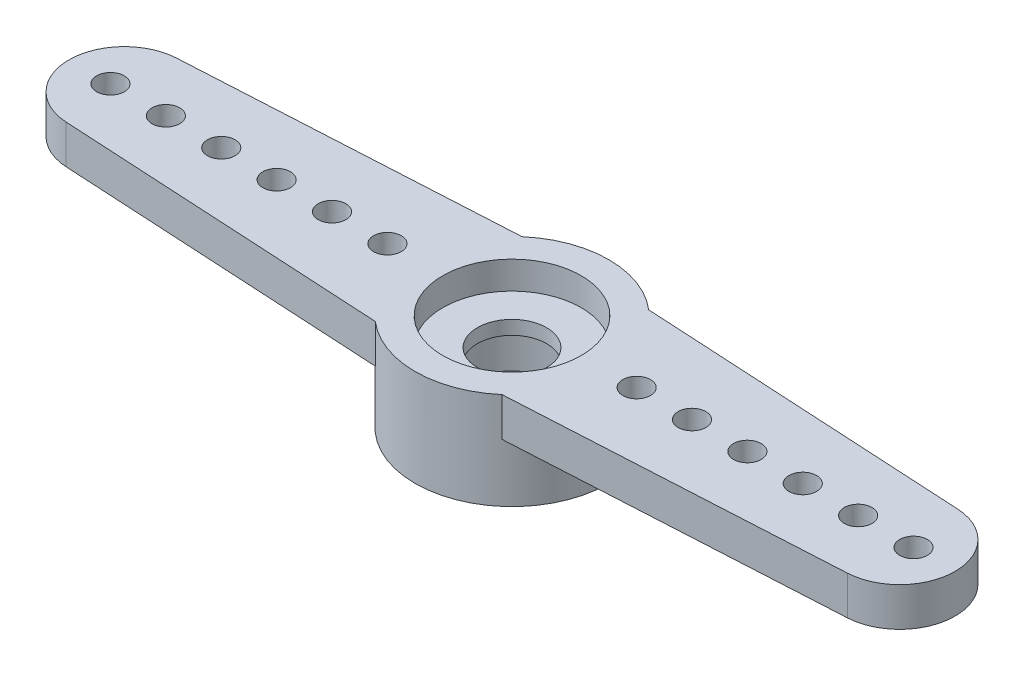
ISO-10303-21;
HEADER;
FILE_DESCRIPTION(('STEP AP214'),'2;1');
FILE_NAME('part.step','',(''),(''),'','','');
FILE_SCHEMA(('AUTOMOTIVE_DESIGN { 1 0 10303 214 1 1 1 1 }'));
ENDSEC;
DATA;
#1=APPLICATION_CONTEXT('core data for automotive mechanical design processes');
#2=APPLICATION_PROTOCOL_DEFINITION('international standard','automotive_design',2000,#1);
#3=PRODUCT_CONTEXT('',#1,'mechanical');
#4=PRODUCT('Part','Part','',(#3));
#5=PRODUCT_RELATED_PRODUCT_CATEGORY('part','',(#4));
#6=PRODUCT_DEFINITION_FORMATION('','',#4);
#7=PRODUCT_DEFINITION_CONTEXT('part definition',#1,'design');
#8=PRODUCT_DEFINITION('design','',#6,#7);
#9=PRODUCT_DEFINITION_SHAPE('','',#8);
#10=(LENGTH_UNIT() NAMED_UNIT(*) SI_UNIT(.MILLI.,.METRE.));
#11=(NAMED_UNIT(*) PLANE_ANGLE_UNIT() SI_UNIT($,.RADIAN.));
#12=(NAMED_UNIT(*) SI_UNIT($,.STERADIAN.) SOLID_ANGLE_UNIT());
#13=UNCERTAINTY_MEASURE_WITH_UNIT(LENGTH_MEASURE(1.E-05),#10,'distance_accuracy_value','');
#14=(GEOMETRIC_REPRESENTATION_CONTEXT(3) GLOBAL_UNCERTAINTY_ASSIGNED_CONTEXT((#13)) GLOBAL_UNIT_ASSIGNED_CONTEXT((#10,
#11,#12)) REPRESENTATION_CONTEXT('',''));
#15=CARTESIAN_POINT('',(0.,0.,0.));
#16=DIRECTION('',(0.,0.,1.));
#17=DIRECTION('',(1.,0.,0.));
#18=AXIS2_PLACEMENT_3D('',#15,#16,#17);
#19=CARTESIAN_POINT('',(0.,0.,0.));
#20=DIRECTION('',(0.,1.,0.));
#21=DIRECTION('',(0.,0.,1.));
#22=AXIS2_PLACEMENT_3D('',#19,#20,#21);
#23=PLANE('',#22);
#24=CARTESIAN_POINT('',(6.5,0.,0.));
#25=DIRECTION('',(0.,-1.,0.));
#26=DIRECTION('',(0.,0.,1.));
#27=AXIS2_PLACEMENT_3D('',#24,#25,#26);
#28=CIRCLE('',#27,0.500000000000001);
#29=CARTESIAN_POINT('',(6.5,0.,0.500000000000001));
#30=VERTEX_POINT('',#29);
#31=EDGE_CURVE('E236',#30,#30,#28,.T.);
#32=ORIENTED_EDGE('',*,*,#31,.T.);
#33=EDGE_LOOP('',(#32));
#34=FACE_BOUND('',#33,.T.);
#35=CARTESIAN_POINT('',(10.5,0.,0.));
#36=DIRECTION('',(0.,-1.,0.));
#37=DIRECTION('',(0.,0.,1.));
#38=AXIS2_PLACEMENT_3D('',#35,#36,#37);
#39=CIRCLE('',#38,0.500000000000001);
#40=CARTESIAN_POINT('',(10.5,0.,0.500000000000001));
#41=VERTEX_POINT('',#40);
#42=EDGE_CURVE('E230',#41,#41,#39,.T.);
#43=ORIENTED_EDGE('',*,*,#42,.T.);
#44=EDGE_LOOP('',(#43));
#45=FACE_BOUND('',#44,.T.);
#46=CARTESIAN_POINT('',(14.5,0.,0.));
#47=DIRECTION('',(0.,-1.,0.));
#48=DIRECTION('',(0.,0.,1.));
#49=AXIS2_PLACEMENT_3D('',#46,#47,#48);
#50=CIRCLE('',#49,0.500000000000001);
#51=CARTESIAN_POINT('',(14.5,0.,0.500000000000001));
#52=VERTEX_POINT('',#51);
#53=EDGE_CURVE('E222',#52,#52,#50,.T.);
#54=ORIENTED_EDGE('',*,*,#53,.T.);
#55=EDGE_LOOP('',(#54));
#56=FACE_BOUND('',#55,.T.);
#57=CARTESIAN_POINT('',(-12.5,0.,0.));
#58=DIRECTION('',(0.,1.,0.));
#59=DIRECTION('',(0.,0.,1.));
#60=AXIS2_PLACEMENT_3D('',#57,#58,#59);
#61=CIRCLE('',#60,0.500000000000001);
#62=CARTESIAN_POINT('',(-12.5,0.,0.500000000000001));
#63=VERTEX_POINT('',#62);
#64=EDGE_CURVE('E256',#63,#63,#61,.T.);
#65=ORIENTED_EDGE('',*,*,#64,.F.);
#66=EDGE_LOOP('',(#65));
#67=FACE_BOUND('',#66,.T.);
#68=CARTESIAN_POINT('',(-14.5,0.,0.));
#69=DIRECTION('',(0.,1.,0.));
#70=DIRECTION('',(0.,0.,1.));
#71=AXIS2_PLACEMENT_3D('',#68,#69,#70);
#72=CIRCLE('',#71,0.500000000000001);
#73=CARTESIAN_POINT('',(-14.5,0.,0.500000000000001));
#74=VERTEX_POINT('',#73);
#75=EDGE_CURVE('E131',#74,#74,#72,.T.);
#76=ORIENTED_EDGE('',*,*,#75,.F.);
#77=EDGE_LOOP('',(#76));
#78=FACE_BOUND('',#77,.T.);
#79=CARTESIAN_POINT('',(0.,0.,0.));
#80=DIRECTION('',(0.,1.,0.));
#81=DIRECTION('',(0.,0.,1.));
#82=AXIS2_PLACEMENT_3D('',#79,#80,#81);
#83=CIRCLE('',#82,2.5);
#84=CARTESIAN_POINT('',(0.,0.,2.5));
#85=VERTEX_POINT('',#84);
#86=EDGE_CURVE('E176',#85,#85,#83,.T.);
#87=ORIENTED_EDGE('',*,*,#86,.F.);
#88=EDGE_LOOP('',(#87));
#89=FACE_BOUND('',#88,.T.);
#90=CARTESIAN_POINT('',(0.,0.,0.));
#91=DIRECTION('',(0.,1.,0.));
#92=DIRECTION('',(0.,0.,1.));
#93=AXIS2_PLACEMENT_3D('',#90,#91,#92);
#94=CIRCLE('',#93,3.5);
#95=CARTESIAN_POINT('',(-2.28637267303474,0.,2.65));
#96=VERTEX_POINT('',#95);
#97=CARTESIAN_POINT('',(2.28637267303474,0.,2.65));
#98=VERTEX_POINT('',#97);
#99=EDGE_CURVE('E193',#96,#98,#94,.T.);
#100=ORIENTED_EDGE('',*,*,#99,.T.);
#101=DIRECTION('',(0.998478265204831,0.,-0.0551466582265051));
#102=VECTOR('',#101,1.);
#103=CARTESIAN_POINT('',(14.110293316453,0.,1.99695653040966));
#104=LINE('',#103,#102);
#105=CARTESIAN_POINT('',(14.110293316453,0.,1.99695653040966));
#106=VERTEX_POINT('',#105);
#107=EDGE_CURVE('E126',#98,#106,#104,.T.);
#108=ORIENTED_EDGE('',*,*,#107,.T.);
#109=CARTESIAN_POINT('',(14.,0.,0.));
#110=DIRECTION('',(0.,1.,0.));
#111=DIRECTION('',(0.,0.,1.));
#112=AXIS2_PLACEMENT_3D('',#109,#110,#111);
#113=CIRCLE('',#112,2.);
#114=CARTESIAN_POINT('',(14.110293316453,0.,-1.99695653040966));
#115=VERTEX_POINT('',#114);
#116=EDGE_CURVE('E136',#106,#115,#113,.T.);
#117=ORIENTED_EDGE('',*,*,#116,.T.);
#118=DIRECTION('',(-0.998478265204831,0.,-0.0551466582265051));
#119=VECTOR('',#118,1.);
#120=CARTESIAN_POINT('',(14.110293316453,0.,-1.99695653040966));
#121=LINE('',#120,#119);
#122=CARTESIAN_POINT('',(2.28637267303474,0.,-2.65));
#123=VERTEX_POINT('',#122);
#124=EDGE_CURVE('E52',#115,#123,#121,.T.);
#125=ORIENTED_EDGE('',*,*,#124,.T.);
#126=CARTESIAN_POINT('',(-2.28637267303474,0.,-2.65));
#127=VERTEX_POINT('',#126);
#128=EDGE_CURVE('E186',#123,#127,#94,.T.);
#129=ORIENTED_EDGE('',*,*,#128,.T.);
#130=DIRECTION('',(-0.998478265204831,0.,0.0551466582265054));
#131=VECTOR('',#130,1.);
#132=CARTESIAN_POINT('',(-14.110293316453,0.,-1.99695653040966));
#133=LINE('',#132,#131);
#134=CARTESIAN_POINT('',(-14.110293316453,0.,-1.99695653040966));
#135=VERTEX_POINT('',#134);
#136=EDGE_CURVE('E150',#127,#135,#133,.T.);
#137=ORIENTED_EDGE('',*,*,#136,.T.);
#138=CARTESIAN_POINT('',(-14.,0.,0.));
#139=DIRECTION('',(0.,1.,0.));
#140=DIRECTION('',(0.,0.,-1.));
#141=AXIS2_PLACEMENT_3D('',#138,#139,#140);
#142=CIRCLE('',#141,2.);
#143=CARTESIAN_POINT('',(-14.110293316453,0.,1.99695653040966));
#144=VERTEX_POINT('',#143);
#145=EDGE_CURVE('E141',#135,#144,#142,.T.);
#146=ORIENTED_EDGE('',*,*,#145,.T.);
#147=DIRECTION('',(0.998478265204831,0.,0.0551466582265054));
#148=VECTOR('',#147,1.);
#149=CARTESIAN_POINT('',(-14.110293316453,0.,1.99695653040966));
#150=LINE('',#149,#148);
#151=EDGE_CURVE('E59',#144,#96,#150,.T.);
#152=ORIENTED_EDGE('',*,*,#151,.T.);
#153=EDGE_LOOP('',(#100,#108,#117,#125,#129,#137,#146,#152));
#154=FACE_BOUND('',#153,.T.);
#155=CARTESIAN_POINT('',(-10.5,0.,0.));
#156=DIRECTION('',(0.,1.,0.));
#157=DIRECTION('',(0.,0.,1.));
#158=AXIS2_PLACEMENT_3D('',#155,#156,#157);
#159=CIRCLE('',#158,0.500000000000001);
#160=CARTESIAN_POINT('',(-10.5,0.,0.500000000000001));
#161=VERTEX_POINT('',#160);
#162=EDGE_CURVE('E201',#161,#161,#159,.T.);
#163=ORIENTED_EDGE('',*,*,#162,.F.);
#164=EDGE_LOOP('',(#163));
#165=FACE_BOUND('',#164,.T.);
#166=CARTESIAN_POINT('',(-8.5,0.,0.));
#167=DIRECTION('',(0.,1.,0.));
#168=DIRECTION('',(0.,0.,1.));
#169=AXIS2_PLACEMENT_3D('',#166,#167,#168);
#170=CIRCLE('',#169,0.500000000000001);
#171=CARTESIAN_POINT('',(-8.5,0.,0.500000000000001));
#172=VERTEX_POINT('',#171);
#173=EDGE_CURVE('E207',#172,#172,#170,.T.);
#174=ORIENTED_EDGE('',*,*,#173,.F.);
#175=EDGE_LOOP('',(#174));
#176=FACE_BOUND('',#175,.T.);
#177=CARTESIAN_POINT('',(-6.5,0.,0.));
#178=DIRECTION('',(0.,1.,0.));
#179=DIRECTION('',(0.,0.,1.));
#180=AXIS2_PLACEMENT_3D('',#177,#178,#179);
#181=CIRCLE('',#180,0.500000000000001);
#182=CARTESIAN_POINT('',(-6.5,0.,0.500000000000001));
#183=VERTEX_POINT('',#182);
#184=EDGE_CURVE('E213',#183,#183,#181,.T.);
#185=ORIENTED_EDGE('',*,*,#184,.F.);
#186=EDGE_LOOP('',(#185));
#187=FACE_BOUND('',#186,.T.);
#188=CARTESIAN_POINT('',(-4.5,0.,0.));
#189=DIRECTION('',(0.,1.,0.));
#190=DIRECTION('',(0.,0.,1.));
#191=AXIS2_PLACEMENT_3D('',#188,#189,#190);
#192=CIRCLE('',#191,0.500000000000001);
#193=CARTESIAN_POINT('',(-4.5,0.,0.500000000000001));
#194=VERTEX_POINT('',#193);
#195=EDGE_CURVE('E11',#194,#194,#192,.T.);
#196=ORIENTED_EDGE('',*,*,#195,.F.);
#197=EDGE_LOOP('',(#196));
#198=FACE_BOUND('',#197,.T.);
#199=CARTESIAN_POINT('',(12.5,0.,0.));
#200=DIRECTION('',(0.,-1.,0.));
#201=DIRECTION('',(0.,0.,1.));
#202=AXIS2_PLACEMENT_3D('',#199,#200,#201);
#203=CIRCLE('',#202,0.500000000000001);
#204=CARTESIAN_POINT('',(12.5,0.,0.500000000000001));
#205=VERTEX_POINT('',#204);
#206=EDGE_CURVE('E226',#205,#205,#203,.T.);
#207=ORIENTED_EDGE('',*,*,#206,.T.);
#208=EDGE_LOOP('',(#207));
#209=FACE_BOUND('',#208,.T.);
#210=CARTESIAN_POINT('',(8.5,0.,0.));
#211=DIRECTION('',(0.,-1.,0.));
#212=DIRECTION('',(0.,0.,1.));
#213=AXIS2_PLACEMENT_3D('',#210,#211,#212);
#214=CIRCLE('',#213,0.500000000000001);
#215=CARTESIAN_POINT('',(8.5,0.,0.500000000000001));
#216=VERTEX_POINT('',#215);
#217=EDGE_CURVE('E233',#216,#216,#214,.T.);
#218=ORIENTED_EDGE('',*,*,#217,.T.);
#219=EDGE_LOOP('',(#218));
#220=FACE_BOUND('',#219,.T.);
#221=CARTESIAN_POINT('',(4.5,0.,0.));
#222=DIRECTION('',(0.,-1.,0.));
#223=DIRECTION('',(0.,0.,1.));
#224=AXIS2_PLACEMENT_3D('',#221,#222,#223);
#225=CIRCLE('',#224,0.500000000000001);
#226=CARTESIAN_POINT('',(4.5,0.,0.500000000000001));
#227=VERTEX_POINT('',#226);
#228=EDGE_CURVE('E246',#227,#227,#225,.T.);
#229=ORIENTED_EDGE('',*,*,#228,.T.);
#230=EDGE_LOOP('',(#229));
#231=FACE_BOUND('',#230,.T.);
#232=ADVANCED_FACE('F35',(#34,#45,#56,#67,#78,#89,#154,#165,#176,#187,#198,#209,#220,#231),#23,.T.);
#233=CARTESIAN_POINT('',(14.,-1.4,0.));
#234=DIRECTION('',(0.,1.,0.));
#235=DIRECTION('',(0.,0.,1.));
#236=AXIS2_PLACEMENT_3D('',#233,#234,#235);
#237=PLANE('',#236);
#238=CARTESIAN_POINT('',(6.5,-1.4,0.));
#239=DIRECTION('',(0.,1.,0.));
#240=DIRECTION('',(0.,0.,1.));
#241=AXIS2_PLACEMENT_3D('',#238,#239,#240);
#242=CIRCLE('',#241,0.500000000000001);
#243=CARTESIAN_POINT('',(6.5,-1.4,0.500000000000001));
#244=VERTEX_POINT('',#243);
#245=EDGE_CURVE('E234',#244,#244,#242,.F.);
#246=ORIENTED_EDGE('',*,*,#245,.F.);
#247=EDGE_LOOP('',(#246));
#248=FACE_BOUND('',#247,.T.);
#249=CARTESIAN_POINT('',(10.5,-1.4,0.));
#250=DIRECTION('',(0.,1.,0.));
#251=DIRECTION('',(0.,0.,1.));
#252=AXIS2_PLACEMENT_3D('',#249,#250,#251);
#253=CIRCLE('',#252,0.500000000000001);
#254=CARTESIAN_POINT('',(10.5,-1.4,0.500000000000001));
#255=VERTEX_POINT('',#254);
#256=EDGE_CURVE('E227',#255,#255,#253,.F.);
#257=ORIENTED_EDGE('',*,*,#256,.F.);
#258=EDGE_LOOP('',(#257));
#259=FACE_BOUND('',#258,.T.);
#260=CARTESIAN_POINT('',(14.5,-1.4,0.));
#261=DIRECTION('',(0.,1.,0.));
#262=DIRECTION('',(0.,0.,1.));
#263=AXIS2_PLACEMENT_3D('',#260,#261,#262);
#264=CIRCLE('',#263,0.500000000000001);
#265=CARTESIAN_POINT('',(14.5,-1.4,0.500000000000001));
#266=VERTEX_POINT('',#265);
#267=EDGE_CURVE('E218',#266,#266,#264,.F.);
#268=ORIENTED_EDGE('',*,*,#267,.F.);
#269=EDGE_LOOP('',(#268));
#270=FACE_BOUND('',#269,.T.);
#271=CARTESIAN_POINT('',(14.,-1.4,0.));
#272=DIRECTION('',(0.,1.,0.));
#273=DIRECTION('',(0.,0.,1.));
#274=AXIS2_PLACEMENT_3D('',#271,#272,#273);
#275=CIRCLE('',#274,2.);
#276=CARTESIAN_POINT('',(14.110293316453,-1.4,1.99695653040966));
#277=VERTEX_POINT('',#276);
#278=CARTESIAN_POINT('',(14.110293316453,-1.4,-1.99695653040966));
#279=VERTEX_POINT('',#278);
#280=EDGE_CURVE('E119',#277,#279,#275,.T.);
#281=ORIENTED_EDGE('',*,*,#280,.F.);
#282=DIRECTION('',(0.998478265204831,0.,-0.0551466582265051));
#283=VECTOR('',#282,1.);
#284=CARTESIAN_POINT('',(14.110293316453,-1.4,1.99695653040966));
#285=LINE('',#284,#283);
#286=CARTESIAN_POINT('',(2.28637267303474,-1.4,2.65));
#287=VERTEX_POINT('',#286);
#288=EDGE_CURVE('E112',#287,#277,#285,.T.);
#289=ORIENTED_EDGE('',*,*,#288,.F.);
#290=CARTESIAN_POINT('',(0.,-1.4,0.));
#291=DIRECTION('',(0.,-1.,0.));
#292=DIRECTION('',(0.,0.,1.));
#293=AXIS2_PLACEMENT_3D('',#290,#291,#292);
#294=CIRCLE('',#293,3.5);
#295=CARTESIAN_POINT('',(2.28637267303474,-1.4,-2.65));
#296=VERTEX_POINT('',#295);
#297=EDGE_CURVE('E122',#296,#287,#294,.T.);
#298=ORIENTED_EDGE('',*,*,#297,.F.);
#299=DIRECTION('',(-0.998478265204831,0.,-0.0551466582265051));
#300=VECTOR('',#299,1.);
#301=CARTESIAN_POINT('',(14.110293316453,-1.4,-1.99695653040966));
#302=LINE('',#301,#300);
#303=EDGE_CURVE('E106',#279,#296,#302,.T.);
#304=ORIENTED_EDGE('',*,*,#303,.F.);
#305=EDGE_LOOP('',(#281,#289,#298,#304));
#306=FACE_BOUND('',#305,.T.);
#307=CARTESIAN_POINT('',(12.5,-1.4,0.));
#308=DIRECTION('',(0.,1.,0.));
#309=DIRECTION('',(0.,0.,1.));
#310=AXIS2_PLACEMENT_3D('',#307,#308,#309);
#311=CIRCLE('',#310,0.500000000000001);
#312=CARTESIAN_POINT('',(12.5,-1.4,0.500000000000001));
#313=VERTEX_POINT('',#312);
#314=EDGE_CURVE('E223',#313,#313,#311,.F.);
#315=ORIENTED_EDGE('',*,*,#314,.F.);
#316=EDGE_LOOP('',(#315));
#317=FACE_BOUND('',#316,.T.);
#318=CARTESIAN_POINT('',(8.5,-1.4,0.));
#319=DIRECTION('',(0.,1.,0.));
#320=DIRECTION('',(0.,0.,1.));
#321=AXIS2_PLACEMENT_3D('',#318,#319,#320);
#322=CIRCLE('',#321,0.500000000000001);
#323=CARTESIAN_POINT('',(8.5,-1.4,0.500000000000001));
#324=VERTEX_POINT('',#323);
#325=EDGE_CURVE('E231',#324,#324,#322,.F.);
#326=ORIENTED_EDGE('',*,*,#325,.F.);
#327=EDGE_LOOP('',(#326));
#328=FACE_BOUND('',#327,.T.);
#329=CARTESIAN_POINT('',(4.5,-1.4,0.));
#330=DIRECTION('',(0.,1.,0.));
#331=DIRECTION('',(0.,0.,1.));
#332=AXIS2_PLACEMENT_3D('',#329,#330,#331);
#333=CIRCLE('',#332,0.500000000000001);
#334=CARTESIAN_POINT('',(4.5,-1.4,0.500000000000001));
#335=VERTEX_POINT('',#334);
#336=EDGE_CURVE('E39',#335,#335,#333,.F.);
#337=ORIENTED_EDGE('',*,*,#336,.F.);
#338=EDGE_LOOP('',(#337));
#339=FACE_BOUND('',#338,.T.);
#340=ADVANCED_FACE('F116',(#248,#259,#270,#306,#317,#328,#339),#237,.F.);
#341=CARTESIAN_POINT('',(0.,-3.5,0.));
#342=DIRECTION('',(0.,1.,0.));
#343=DIRECTION('',(0.,0.,1.));
#344=AXIS2_PLACEMENT_3D('',#341,#342,#343);
#345=CYLINDRICAL_SURFACE('',#344,3.5);
#346=DIRECTION('',(0.,1.,0.));
#347=VECTOR('',#346,1.);
#348=CARTESIAN_POINT('',(2.28637267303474,-1.4,2.65));
#349=LINE('',#348,#347);
#350=EDGE_CURVE('E142',#287,#98,#349,.T.);
#351=ORIENTED_EDGE('',*,*,#350,.T.);
#352=ORIENTED_EDGE('',*,*,#99,.F.);
#353=DIRECTION('',(0.,1.,0.));
#354=VECTOR('',#353,1.);
#355=CARTESIAN_POINT('',(-2.28637267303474,-1.4,2.65));
#356=LINE('',#355,#354);
#357=CARTESIAN_POINT('',(-2.28637267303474,-1.4,2.65));
#358=VERTEX_POINT('',#357);
#359=EDGE_CURVE('E170',#358,#96,#356,.T.);
#360=ORIENTED_EDGE('',*,*,#359,.F.);
#361=CARTESIAN_POINT('',(0.,-1.4,0.));
#362=DIRECTION('',(0.,-1.,0.));
#363=DIRECTION('',(0.,0.,1.));
#364=AXIS2_PLACEMENT_3D('',#361,#362,#363);
#365=CIRCLE('',#364,3.5);
#366=CARTESIAN_POINT('',(-2.28637267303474,-1.4,-2.65));
#367=VERTEX_POINT('',#366);
#368=EDGE_CURVE('E153',#358,#367,#365,.T.);
#369=ORIENTED_EDGE('',*,*,#368,.T.);
#370=DIRECTION('',(0.,1.,0.));
#371=VECTOR('',#370,1.);
#372=CARTESIAN_POINT('',(-2.28637267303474,-1.4,-2.65));
#373=LINE('',#372,#371);
#374=EDGE_CURVE('E167',#367,#127,#373,.T.);
#375=ORIENTED_EDGE('',*,*,#374,.T.);
#376=ORIENTED_EDGE('',*,*,#128,.F.);
#377=DIRECTION('',(0.,1.,0.));
#378=VECTOR('',#377,1.);
#379=CARTESIAN_POINT('',(2.28637267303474,-1.4,-2.65));
#380=LINE('',#379,#378);
#381=EDGE_CURVE('E111',#296,#123,#380,.T.);
#382=ORIENTED_EDGE('',*,*,#381,.F.);
#383=ORIENTED_EDGE('',*,*,#297,.T.);
#384=EDGE_LOOP('',(#351,#352,#360,#369,#375,#376,#382,#383));
#385=FACE_BOUND('',#384,.T.);
#386=CARTESIAN_POINT('',(0.,-3.5,0.));
#387=DIRECTION('',(0.,1.,0.));
#388=DIRECTION('',(0.,0.,1.));
#389=AXIS2_PLACEMENT_3D('',#386,#387,#388);
#390=CIRCLE('',#389,3.5);
#391=CARTESIAN_POINT('',(0.,-3.5,3.5));
#392=VERTEX_POINT('',#391);
#393=EDGE_CURVE('E189',#392,#392,#390,.T.);
#394=ORIENTED_EDGE('',*,*,#393,.T.);
#395=EDGE_LOOP('',(#394));
#396=FACE_BOUND('',#395,.T.);
#397=ADVANCED_FACE('F294',(#385,#396),#345,.T.);
#398=CARTESIAN_POINT('',(0.,-3.5,0.));
#399=DIRECTION('',(0.,1.,0.));
#400=DIRECTION('',(0.,0.,1.));
#401=AXIS2_PLACEMENT_3D('',#398,#399,#400);
#402=PLANE('',#401);
#403=CARTESIAN_POINT('',(0.,-3.5,0.));
#404=DIRECTION('',(0.,-1.,0.));
#405=DIRECTION('',(0.,0.,-1.));
#406=AXIS2_PLACEMENT_3D('',#403,#404,#405);
#407=CIRCLE('',#406,2.5);
#408=CARTESIAN_POINT('',(0.,-3.5,-2.5));
#409=VERTEX_POINT('',#408);
#410=EDGE_CURVE('E180',#409,#409,#407,.T.);
#411=ORIENTED_EDGE('',*,*,#410,.F.);
#412=EDGE_LOOP('',(#411));
#413=FACE_BOUND('',#412,.T.);
#414=ORIENTED_EDGE('',*,*,#393,.F.);
#415=EDGE_LOOP('',(#414));
#416=FACE_BOUND('',#415,.T.);
#417=ADVANCED_FACE('F301',(#413,#416),#402,.F.);
#418=CARTESIAN_POINT('',(0.,-1.5,0.));
#419=DIRECTION('',(0.,-1.,0.));
#420=DIRECTION('',(0.,0.,-1.));
#421=AXIS2_PLACEMENT_3D('',#418,#419,#420);
#422=CYLINDRICAL_SURFACE('',#421,2.5);
#423=CARTESIAN_POINT('',(0.,-1.5,0.));
#424=DIRECTION('',(0.,-1.,0.));
#425=DIRECTION('',(0.,0.,-1.));
#426=AXIS2_PLACEMENT_3D('',#423,#424,#425);
#427=CIRCLE('',#426,2.5);
#428=CARTESIAN_POINT('',(0.,-1.5,-2.5));
#429=VERTEX_POINT('',#428);
#430=EDGE_CURVE('E183',#429,#429,#427,.T.);
#431=ORIENTED_EDGE('',*,*,#430,.F.);
#432=EDGE_LOOP('',(#431));
#433=FACE_BOUND('',#432,.T.);
#434=ORIENTED_EDGE('',*,*,#410,.T.);
#435=EDGE_LOOP('',(#434));
#436=FACE_BOUND('',#435,.T.);
#437=ADVANCED_FACE('F347',(#433,#436),#422,.F.);
#438=CARTESIAN_POINT('',(0.,-1.5,0.));
#439=DIRECTION('',(0.,-1.,0.));
#440=DIRECTION('',(0.,0.,-1.));
#441=AXIS2_PLACEMENT_3D('',#438,#439,#440);
#442=PLANE('',#441);
#443=CARTESIAN_POINT('',(0.,-1.5,0.));
#444=DIRECTION('',(0.,-1.,0.));
#445=DIRECTION('',(0.,0.,-1.));
#446=AXIS2_PLACEMENT_3D('',#443,#444,#445);
#447=CIRCLE('',#446,1.25);
#448=CARTESIAN_POINT('',(0.,-1.5,-1.25));
#449=VERTEX_POINT('',#448);
#450=EDGE_CURVE('E173',#449,#449,#447,.T.);
#451=ORIENTED_EDGE('',*,*,#450,.F.);
#452=EDGE_LOOP('',(#451));
#453=FACE_BOUND('',#452,.T.);
#454=ORIENTED_EDGE('',*,*,#430,.T.);
#455=EDGE_LOOP('',(#454));
#456=FACE_BOUND('',#455,.T.);
#457=ADVANCED_FACE('F343',(#453,#456),#442,.T.);
#458=CARTESIAN_POINT('',(0.,-1.,0.));
#459=DIRECTION('',(0.,1.,0.));
#460=DIRECTION('',(0.,0.,1.));
#461=AXIS2_PLACEMENT_3D('',#458,#459,#460);
#462=CYLINDRICAL_SURFACE('',#461,2.5);
#463=CARTESIAN_POINT('',(0.,-1.,0.));
#464=DIRECTION('',(0.,1.,0.));
#465=DIRECTION('',(0.,0.,1.));
#466=AXIS2_PLACEMENT_3D('',#463,#464,#465);
#467=CIRCLE('',#466,2.5);
#468=CARTESIAN_POINT('',(0.,-1.,2.5));
#469=VERTEX_POINT('',#468);
#470=EDGE_CURVE('E177',#469,#469,#467,.T.);
#471=ORIENTED_EDGE('',*,*,#470,.F.);
#472=EDGE_LOOP('',(#471));
#473=FACE_BOUND('',#472,.T.);
#474=ORIENTED_EDGE('',*,*,#86,.T.);
#475=EDGE_LOOP('',(#474));
#476=FACE_BOUND('',#475,.T.);
#477=ADVANCED_FACE('F339',(#473,#476),#462,.F.);
#478=CARTESIAN_POINT('',(0.,-1.,0.));
#479=DIRECTION('',(0.,1.,0.));
#480=DIRECTION('',(0.,0.,1.));
#481=AXIS2_PLACEMENT_3D('',#478,#479,#480);
#482=PLANE('',#481);
#483=CARTESIAN_POINT('',(0.,-1.,0.));
#484=DIRECTION('',(0.,1.,0.));
#485=DIRECTION('',(0.,0.,1.));
#486=AXIS2_PLACEMENT_3D('',#483,#484,#485);
#487=CIRCLE('',#486,1.25);
#488=CARTESIAN_POINT('',(0.,-1.,1.25));
#489=VERTEX_POINT('',#488);
#490=EDGE_CURVE('E166',#489,#489,#487,.T.);
#491=ORIENTED_EDGE('',*,*,#490,.F.);
#492=EDGE_LOOP('',(#491));
#493=FACE_BOUND('',#492,.T.);
#494=ORIENTED_EDGE('',*,*,#470,.T.);
#495=EDGE_LOOP('',(#494));
#496=FACE_BOUND('',#495,.T.);
#497=ADVANCED_FACE('F335',(#493,#496),#482,.T.);
#498=CARTESIAN_POINT('',(0.,-3.5,0.));
#499=DIRECTION('',(0.,1.,0.));
#500=DIRECTION('',(0.,0.,1.));
#501=AXIS2_PLACEMENT_3D('',#498,#499,#500);
#502=CYLINDRICAL_SURFACE('',#501,1.25);
#503=ORIENTED_EDGE('',*,*,#450,.T.);
#504=EDGE_LOOP('',(#503));
#505=FACE_BOUND('',#504,.T.);
#506=ORIENTED_EDGE('',*,*,#490,.T.);
#507=EDGE_LOOP('',(#506));
#508=FACE_BOUND('',#507,.T.);
#509=ADVANCED_FACE('F331',(#505,#508),#502,.F.);
#510=CARTESIAN_POINT('',(-14.,-1.4,0.));
#511=DIRECTION('',(0.,1.,0.));
#512=DIRECTION('',(0.,0.,1.));
#513=AXIS2_PLACEMENT_3D('',#510,#511,#512);
#514=CYLINDRICAL_SURFACE('',#513,2.);
#515=ORIENTED_EDGE('',*,*,#145,.F.);
#516=DIRECTION('',(0.,1.,0.));
#517=VECTOR('',#516,1.);
#518=CARTESIAN_POINT('',(-14.110293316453,-1.4,-1.99695653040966));
#519=LINE('',#518,#517);
#520=CARTESIAN_POINT('',(-14.110293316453,-1.4,-1.99695653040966));
#521=VERTEX_POINT('',#520);
#522=EDGE_CURVE('E164',#521,#135,#519,.T.);
#523=ORIENTED_EDGE('',*,*,#522,.F.);
#524=CARTESIAN_POINT('',(-14.,-1.4,0.));
#525=DIRECTION('',(0.,1.,0.));
#526=DIRECTION('',(0.,0.,-1.));
#527=AXIS2_PLACEMENT_3D('',#524,#525,#526);
#528=CIRCLE('',#527,2.);
#529=CARTESIAN_POINT('',(-14.110293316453,-1.4,1.99695653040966));
#530=VERTEX_POINT('',#529);
#531=EDGE_CURVE('E146',#521,#530,#528,.T.);
#532=ORIENTED_EDGE('',*,*,#531,.T.);
#533=DIRECTION('',(0.,1.,0.));
#534=VECTOR('',#533,1.);
#535=CARTESIAN_POINT('',(-14.110293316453,-1.4,1.99695653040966));
#536=LINE('',#535,#534);
#537=EDGE_CURVE('E159',#530,#144,#536,.T.);
#538=ORIENTED_EDGE('',*,*,#537,.T.);
#539=EDGE_LOOP('',(#515,#523,#532,#538));
#540=FACE_BOUND('',#539,.T.);
#541=ADVANCED_FACE('F324',(#540),#514,.T.);
#542=CARTESIAN_POINT('',(-14.110293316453,-1.4,-1.99695653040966));
#543=DIRECTION('',(-0.0551466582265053,0.,-0.998478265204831));
#544=DIRECTION('',(-0.998478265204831,0.,0.0551466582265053));
#545=AXIS2_PLACEMENT_3D('',#542,#543,#544);
#546=PLANE('',#545);
#547=ORIENTED_EDGE('',*,*,#136,.F.);
#548=ORIENTED_EDGE('',*,*,#374,.F.);
#549=DIRECTION('',(-0.998478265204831,0.,0.0551466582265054));
#550=VECTOR('',#549,1.);
#551=CARTESIAN_POINT('',(-14.110293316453,-1.4,-1.99695653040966));
#552=LINE('',#551,#550);
#553=EDGE_CURVE('E156',#367,#521,#552,.T.);
#554=ORIENTED_EDGE('',*,*,#553,.T.);
#555=ORIENTED_EDGE('',*,*,#522,.T.);
#556=EDGE_LOOP('',(#547,#548,#554,#555));
#557=FACE_BOUND('',#556,.T.);
#558=ADVANCED_FACE('F321',(#557),#546,.T.);
#559=CARTESIAN_POINT('',(-14.110293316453,-1.4,1.99695653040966));
#560=DIRECTION('',(-0.0551466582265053,0.,0.998478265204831));
#561=DIRECTION('',(0.998478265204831,0.,0.0551466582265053));
#562=AXIS2_PLACEMENT_3D('',#559,#560,#561);
#563=PLANE('',#562);
#564=ORIENTED_EDGE('',*,*,#151,.F.);
#565=ORIENTED_EDGE('',*,*,#537,.F.);
#566=DIRECTION('',(0.998478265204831,0.,0.0551466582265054));
#567=VECTOR('',#566,1.);
#568=CARTESIAN_POINT('',(-14.110293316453,-1.4,1.99695653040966));
#569=LINE('',#568,#567);
#570=EDGE_CURVE('E149',#530,#358,#569,.T.);
#571=ORIENTED_EDGE('',*,*,#570,.T.);
#572=ORIENTED_EDGE('',*,*,#359,.T.);
#573=EDGE_LOOP('',(#564,#565,#571,#572));
#574=FACE_BOUND('',#573,.T.);
#575=ADVANCED_FACE('F319',(#574),#563,.T.);
#576=CARTESIAN_POINT('',(-14.,-1.4,0.));
#577=DIRECTION('',(0.,-1.,0.));
#578=DIRECTION('',(0.,0.,-1.));
#579=AXIS2_PLACEMENT_3D('',#576,#577,#578);
#580=PLANE('',#579);
#581=CARTESIAN_POINT('',(-12.5,-1.4,0.));
#582=DIRECTION('',(0.,-1.,0.));
#583=DIRECTION('',(0.,0.,-1.));
#584=AXIS2_PLACEMENT_3D('',#581,#582,#583);
#585=CIRCLE('',#584,0.500000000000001);
#586=CARTESIAN_POINT('',(-12.5,-1.4,-0.500000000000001));
#587=VERTEX_POINT('',#586);
#588=EDGE_CURVE('E221',#587,#587,#585,.T.);
#589=ORIENTED_EDGE('',*,*,#588,.F.);
#590=EDGE_LOOP('',(#589));
#591=FACE_BOUND('',#590,.T.);
#592=CARTESIAN_POINT('',(-14.5,-1.4,0.));
#593=DIRECTION('',(0.,-1.,0.));
#594=DIRECTION('',(0.,0.,-1.));
#595=AXIS2_PLACEMENT_3D('',#592,#593,#594);
#596=CIRCLE('',#595,0.500000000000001);
#597=CARTESIAN_POINT('',(-14.5,-1.4,-0.500000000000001));
#598=VERTEX_POINT('',#597);
#599=EDGE_CURVE('E138',#598,#598,#596,.T.);
#600=ORIENTED_EDGE('',*,*,#599,.F.);
#601=EDGE_LOOP('',(#600));
#602=FACE_BOUND('',#601,.T.);
#603=ORIENTED_EDGE('',*,*,#531,.F.);
#604=ORIENTED_EDGE('',*,*,#553,.F.);
#605=ORIENTED_EDGE('',*,*,#368,.F.);
#606=ORIENTED_EDGE('',*,*,#570,.F.);
#607=EDGE_LOOP('',(#603,#604,#605,#606));
#608=FACE_BOUND('',#607,.T.);
#609=CARTESIAN_POINT('',(-10.5,-1.4,0.));
#610=DIRECTION('',(0.,-1.,0.));
#611=DIRECTION('',(0.,0.,-1.));
#612=AXIS2_PLACEMENT_3D('',#609,#610,#611);
#613=CIRCLE('',#612,0.500000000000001);
#614=CARTESIAN_POINT('',(-10.5,-1.4,-0.500000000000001));
#615=VERTEX_POINT('',#614);
#616=EDGE_CURVE('E192',#615,#615,#613,.T.);
#617=ORIENTED_EDGE('',*,*,#616,.F.);
#618=EDGE_LOOP('',(#617));
#619=FACE_BOUND('',#618,.T.);
#620=CARTESIAN_POINT('',(-8.5,-1.4,0.));
#621=DIRECTION('',(0.,-1.,0.));
#622=DIRECTION('',(0.,0.,-1.));
#623=AXIS2_PLACEMENT_3D('',#620,#621,#622);
#624=CIRCLE('',#623,0.500000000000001);
#625=CARTESIAN_POINT('',(-8.5,-1.4,-0.500000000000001));
#626=VERTEX_POINT('',#625);
#627=EDGE_CURVE('E204',#626,#626,#624,.T.);
#628=ORIENTED_EDGE('',*,*,#627,.F.);
#629=EDGE_LOOP('',(#628));
#630=FACE_BOUND('',#629,.T.);
#631=CARTESIAN_POINT('',(-6.5,-1.4,0.));
#632=DIRECTION('',(0.,-1.,0.));
#633=DIRECTION('',(0.,0.,-1.));
#634=AXIS2_PLACEMENT_3D('',#631,#632,#633);
#635=CIRCLE('',#634,0.500000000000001);
#636=CARTESIAN_POINT('',(-6.5,-1.4,-0.500000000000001));
#637=VERTEX_POINT('',#636);
#638=EDGE_CURVE('E210',#637,#637,#635,.T.);
#639=ORIENTED_EDGE('',*,*,#638,.F.);
#640=EDGE_LOOP('',(#639));
#641=FACE_BOUND('',#640,.T.);
#642=CARTESIAN_POINT('',(-4.5,-1.4,0.));
#643=DIRECTION('',(0.,-1.,0.));
#644=DIRECTION('',(0.,0.,-1.));
#645=AXIS2_PLACEMENT_3D('',#642,#643,#644);
#646=CIRCLE('',#645,0.500000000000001);
#647=CARTESIAN_POINT('',(-4.5,-1.4,-0.500000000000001));
#648=VERTEX_POINT('',#647);
#649=EDGE_CURVE('E44',#648,#648,#646,.T.);
#650=ORIENTED_EDGE('',*,*,#649,.F.);
#651=EDGE_LOOP('',(#650));
#652=FACE_BOUND('',#651,.T.);
#653=ADVANCED_FACE('F316',(#591,#602,#608,#619,#630,#641,#652),#580,.T.);
#654=CARTESIAN_POINT('',(14.,-1.4,0.));
#655=DIRECTION('',(0.,1.,0.));
#656=DIRECTION('',(0.,0.,1.));
#657=AXIS2_PLACEMENT_3D('',#654,#655,#656);
#658=CYLINDRICAL_SURFACE('',#657,2.);
#659=ORIENTED_EDGE('',*,*,#116,.F.);
#660=DIRECTION('',(0.,1.,0.));
#661=VECTOR('',#660,1.);
#662=CARTESIAN_POINT('',(14.110293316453,-1.4,1.99695653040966));
#663=LINE('',#662,#661);
#664=EDGE_CURVE('E125',#277,#106,#663,.T.);
#665=ORIENTED_EDGE('',*,*,#664,.F.);
#666=ORIENTED_EDGE('',*,*,#280,.T.);
#667=DIRECTION('',(0.,1.,0.));
#668=VECTOR('',#667,1.);
#669=CARTESIAN_POINT('',(14.110293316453,-1.4,-1.99695653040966));
#670=LINE('',#669,#668);
#671=EDGE_CURVE('E103',#279,#115,#670,.T.);
#672=ORIENTED_EDGE('',*,*,#671,.T.);
#673=EDGE_LOOP('',(#659,#665,#666,#672));
#674=FACE_BOUND('',#673,.T.);
#675=ADVANCED_FACE('F124',(#674),#658,.T.);
#676=CARTESIAN_POINT('',(14.110293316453,-1.4,1.99695653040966));
#677=DIRECTION('',(0.0551466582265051,0.,0.998478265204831));
#678=DIRECTION('',(0.998478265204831,0.,-0.0551466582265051));
#679=AXIS2_PLACEMENT_3D('',#676,#677,#678);
#680=PLANE('',#679);
#681=ORIENTED_EDGE('',*,*,#107,.F.);
#682=ORIENTED_EDGE('',*,*,#350,.F.);
#683=ORIENTED_EDGE('',*,*,#288,.T.);
#684=ORIENTED_EDGE('',*,*,#664,.T.);
#685=EDGE_LOOP('',(#681,#682,#683,#684));
#686=FACE_BOUND('',#685,.T.);
#687=ADVANCED_FACE('F308',(#686),#680,.T.);
#688=CARTESIAN_POINT('',(14.110293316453,-1.4,-1.99695653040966));
#689=DIRECTION('',(0.0551466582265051,0.,-0.998478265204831));
#690=DIRECTION('',(-0.998478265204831,0.,-0.0551466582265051));
#691=AXIS2_PLACEMENT_3D('',#688,#689,#690);
#692=PLANE('',#691);
#693=ORIENTED_EDGE('',*,*,#124,.F.);
#694=ORIENTED_EDGE('',*,*,#671,.F.);
#695=ORIENTED_EDGE('',*,*,#303,.T.);
#696=ORIENTED_EDGE('',*,*,#381,.T.);
#697=EDGE_LOOP('',(#693,#694,#695,#696));
#698=FACE_BOUND('',#697,.T.);
#699=ADVANCED_FACE('F105',(#698),#692,.T.);
#700=CARTESIAN_POINT('',(-14.5,-3.5,0.));
#701=DIRECTION('',(0.,1.,0.));
#702=DIRECTION('',(0.,0.,1.));
#703=AXIS2_PLACEMENT_3D('',#700,#701,#702);
#704=CYLINDRICAL_SURFACE('',#703,0.500000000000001);
#705=ORIENTED_EDGE('',*,*,#599,.T.);
#706=EDGE_LOOP('',(#705));
#707=FACE_BOUND('',#706,.T.);
#708=ORIENTED_EDGE('',*,*,#75,.T.);
#709=EDGE_LOOP('',(#708));
#710=FACE_BOUND('',#709,.T.);
#711=ADVANCED_FACE('F263',(#707,#710),#704,.F.);
#712=CARTESIAN_POINT('',(-12.5,-3.5,0.));
#713=DIRECTION('',(0.,1.,0.));
#714=DIRECTION('',(0.,0.,1.));
#715=AXIS2_PLACEMENT_3D('',#712,#713,#714);
#716=CYLINDRICAL_SURFACE('',#715,0.500000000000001);
#717=ORIENTED_EDGE('',*,*,#588,.T.);
#718=EDGE_LOOP('',(#717));
#719=FACE_BOUND('',#718,.T.);
#720=ORIENTED_EDGE('',*,*,#64,.T.);
#721=EDGE_LOOP('',(#720));
#722=FACE_BOUND('',#721,.T.);
#723=ADVANCED_FACE('F359',(#719,#722),#716,.F.);
#724=CARTESIAN_POINT('',(-10.5,-3.5,0.));
#725=DIRECTION('',(0.,1.,0.));
#726=DIRECTION('',(0.,0.,1.));
#727=AXIS2_PLACEMENT_3D('',#724,#725,#726);
#728=CYLINDRICAL_SURFACE('',#727,0.500000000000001);
#729=ORIENTED_EDGE('',*,*,#616,.T.);
#730=EDGE_LOOP('',(#729));
#731=FACE_BOUND('',#730,.T.);
#732=ORIENTED_EDGE('',*,*,#162,.T.);
#733=EDGE_LOOP('',(#732));
#734=FACE_BOUND('',#733,.T.);
#735=ADVANCED_FACE('F355',(#731,#734),#728,.F.);
#736=CARTESIAN_POINT('',(-8.5,-3.5,0.));
#737=DIRECTION('',(0.,1.,0.));
#738=DIRECTION('',(0.,0.,1.));
#739=AXIS2_PLACEMENT_3D('',#736,#737,#738);
#740=CYLINDRICAL_SURFACE('',#739,0.500000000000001);
#741=ORIENTED_EDGE('',*,*,#627,.T.);
#742=EDGE_LOOP('',(#741));
#743=FACE_BOUND('',#742,.T.);
#744=ORIENTED_EDGE('',*,*,#173,.T.);
#745=EDGE_LOOP('',(#744));
#746=FACE_BOUND('',#745,.T.);
#747=ADVANCED_FACE('F358',(#743,#746),#740,.F.);
#748=CARTESIAN_POINT('',(-6.5,-3.5,0.));
#749=DIRECTION('',(0.,1.,0.));
#750=DIRECTION('',(0.,0.,1.));
#751=AXIS2_PLACEMENT_3D('',#748,#749,#750);
#752=CYLINDRICAL_SURFACE('',#751,0.500000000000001);
#753=ORIENTED_EDGE('',*,*,#638,.T.);
#754=EDGE_LOOP('',(#753));
#755=FACE_BOUND('',#754,.T.);
#756=ORIENTED_EDGE('',*,*,#184,.T.);
#757=EDGE_LOOP('',(#756));
#758=FACE_BOUND('',#757,.T.);
#759=ADVANCED_FACE('F362',(#755,#758),#752,.F.);
#760=CARTESIAN_POINT('',(-4.5,-3.5,0.));
#761=DIRECTION('',(0.,1.,0.));
#762=DIRECTION('',(0.,0.,1.));
#763=AXIS2_PLACEMENT_3D('',#760,#761,#762);
#764=CYLINDRICAL_SURFACE('',#763,0.500000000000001);
#765=ORIENTED_EDGE('',*,*,#649,.T.);
#766=EDGE_LOOP('',(#765));
#767=FACE_BOUND('',#766,.T.);
#768=ORIENTED_EDGE('',*,*,#195,.T.);
#769=EDGE_LOOP('',(#768));
#770=FACE_BOUND('',#769,.T.);
#771=ADVANCED_FACE('F37',(#767,#770),#764,.F.);
#772=CARTESIAN_POINT('',(14.5,-3.5,0.));
#773=DIRECTION('',(0.,1.,0.));
#774=DIRECTION('',(0.,0.,1.));
#775=AXIS2_PLACEMENT_3D('',#772,#773,#774);
#776=CYLINDRICAL_SURFACE('',#775,0.500000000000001);
#777=ORIENTED_EDGE('',*,*,#53,.F.);
#778=EDGE_LOOP('',(#777));
#779=FACE_BOUND('',#778,.T.);
#780=ORIENTED_EDGE('',*,*,#267,.T.);
#781=EDGE_LOOP('',(#780));
#782=FACE_BOUND('',#781,.T.);
#783=ADVANCED_FACE('F369',(#779,#782),#776,.F.);
#784=CARTESIAN_POINT('',(12.5,-3.5,0.));
#785=DIRECTION('',(0.,1.,0.));
#786=DIRECTION('',(0.,0.,1.));
#787=AXIS2_PLACEMENT_3D('',#784,#785,#786);
#788=CYLINDRICAL_SURFACE('',#787,0.500000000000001);
#789=ORIENTED_EDGE('',*,*,#206,.F.);
#790=EDGE_LOOP('',(#789));
#791=FACE_BOUND('',#790,.T.);
#792=ORIENTED_EDGE('',*,*,#314,.T.);
#793=EDGE_LOOP('',(#792));
#794=FACE_BOUND('',#793,.T.);
#795=ADVANCED_FACE('F380',(#791,#794),#788,.F.);
#796=CARTESIAN_POINT('',(10.5,-3.5,0.));
#797=DIRECTION('',(0.,1.,0.));
#798=DIRECTION('',(0.,0.,1.));
#799=AXIS2_PLACEMENT_3D('',#796,#797,#798);
#800=CYLINDRICAL_SURFACE('',#799,0.500000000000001);
#801=ORIENTED_EDGE('',*,*,#42,.F.);
#802=EDGE_LOOP('',(#801));
#803=FACE_BOUND('',#802,.T.);
#804=ORIENTED_EDGE('',*,*,#256,.T.);
#805=EDGE_LOOP('',(#804));
#806=FACE_BOUND('',#805,.T.);
#807=ADVANCED_FACE('F385',(#803,#806),#800,.F.);
#808=CARTESIAN_POINT('',(8.5,-3.5,0.));
#809=DIRECTION('',(0.,1.,0.));
#810=DIRECTION('',(0.,0.,1.));
#811=AXIS2_PLACEMENT_3D('',#808,#809,#810);
#812=CYLINDRICAL_SURFACE('',#811,0.500000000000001);
#813=ORIENTED_EDGE('',*,*,#217,.F.);
#814=EDGE_LOOP('',(#813));
#815=FACE_BOUND('',#814,.T.);
#816=ORIENTED_EDGE('',*,*,#325,.T.);
#817=EDGE_LOOP('',(#816));
#818=FACE_BOUND('',#817,.T.);
#819=ADVANCED_FACE('F562',(#815,#818),#812,.F.);
#820=CARTESIAN_POINT('',(6.5,-3.5,0.));
#821=DIRECTION('',(0.,1.,0.));
#822=DIRECTION('',(0.,0.,1.));
#823=AXIS2_PLACEMENT_3D('',#820,#821,#822);
#824=CYLINDRICAL_SURFACE('',#823,0.500000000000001);
#825=ORIENTED_EDGE('',*,*,#31,.F.);
#826=EDGE_LOOP('',(#825));
#827=FACE_BOUND('',#826,.T.);
#828=ORIENTED_EDGE('',*,*,#245,.T.);
#829=EDGE_LOOP('',(#828));
#830=FACE_BOUND('',#829,.T.);
#831=ADVANCED_FACE('F289',(#827,#830),#824,.F.);
#832=CARTESIAN_POINT('',(4.5,-3.5,0.));
#833=DIRECTION('',(0.,1.,0.));
#834=DIRECTION('',(0.,0.,1.));
#835=AXIS2_PLACEMENT_3D('',#832,#833,#834);
#836=CYLINDRICAL_SURFACE('',#835,0.500000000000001);
#837=ORIENTED_EDGE('',*,*,#228,.F.);
#838=EDGE_LOOP('',(#837));
#839=FACE_BOUND('',#838,.T.);
#840=ORIENTED_EDGE('',*,*,#336,.T.);
#841=EDGE_LOOP('',(#840));
#842=FACE_BOUND('',#841,.T.);
#843=ADVANCED_FACE('F286',(#839,#842),#836,.F.);
#844=CLOSED_SHELL('',(#232,#340,#397,#417,#437,#457,#477,#497,#509,#541,#558,#575,#653,#675,
#687,#699,#711,#723,#735,#747,#759,#771,#783,#795,#807,#819,#831,#843));
#845=MANIFOLD_SOLID_BREP('B2',#844);
#846=ADVANCED_BREP_SHAPE_REPRESENTATION('',(#18,#845),#14);
#847=SHAPE_DEFINITION_REPRESENTATION(#9,#846);
ENDSEC;
END-ISO-10303-21;
